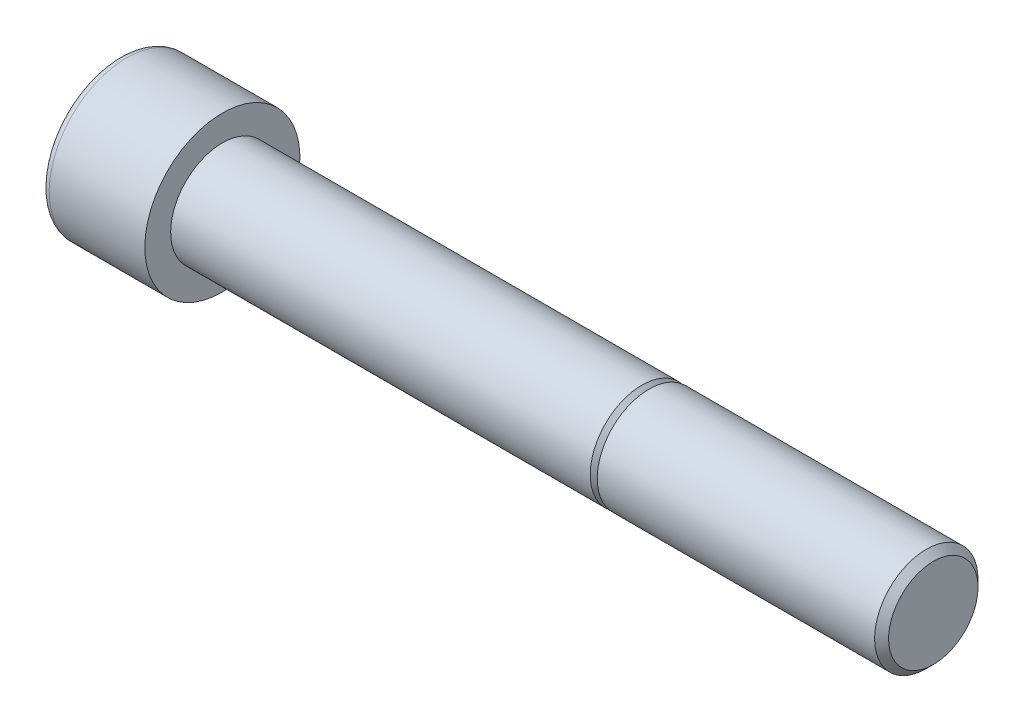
from build123d import *

# Parameters (mm, degrees)
ENL_V_MAT_EXTRU_1_DEPTH = 8
CHANFREIN1_SIZE         = 1.0825
CONG_1_R                = 1.2


with BuildPart() as part:
    # Esquisse1 → R_volution1 (revolve)
    with BuildSketch(Plane(origin=(0, 0, 0), x_dir=(-1, 0, 0), z_dir=(0, 0, -1)), mode=Mode.PRIVATE) as r_volution1_sk:
        Polygon((-80, 8), (-80, 0), (46, 0), (46, 12), (30, 12), (30, 8), (-34.9175, 8), (-36, 6.9175), (-36, 8), align=None)
    revolve(r_volution1_sk.sketch.rotate(Axis((80, 0, 0), (-1, 0, 0)), 180), axis=Axis((80, 0, 0), (-1, 0, 0)))

    # Esquisse2 → Enl_v. mat.-Extru.1 (cut)
    with BuildSketch(Plane.ZY.offset(46)):
        Polygon((-7, -4.041451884), (0, -8.082903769), (7, -4.041451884), (7, 4.041451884), (0, 8.082903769), (-7, 4.041451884), align=None)
    extrude(amount=-ENL_V_MAT_EXTRU_1_DEPTH, mode=Mode.SUBTRACT)

    # Chanfrein1
    chanfrein1_edges = [part.edges().sort_by_distance(p)[0] for p in [
        (80, 8, 0),
    ]]
    chamfer(chanfrein1_edges, length=CHANFREIN1_SIZE)

    # Cong_1
    cong_1_edges = [part.edges().sort_by_distance(p)[0] for p in [
        (-46, 12, 0),
    ]]
    fillet(cong_1_edges, radius=CONG_1_R)


solid = part.part
